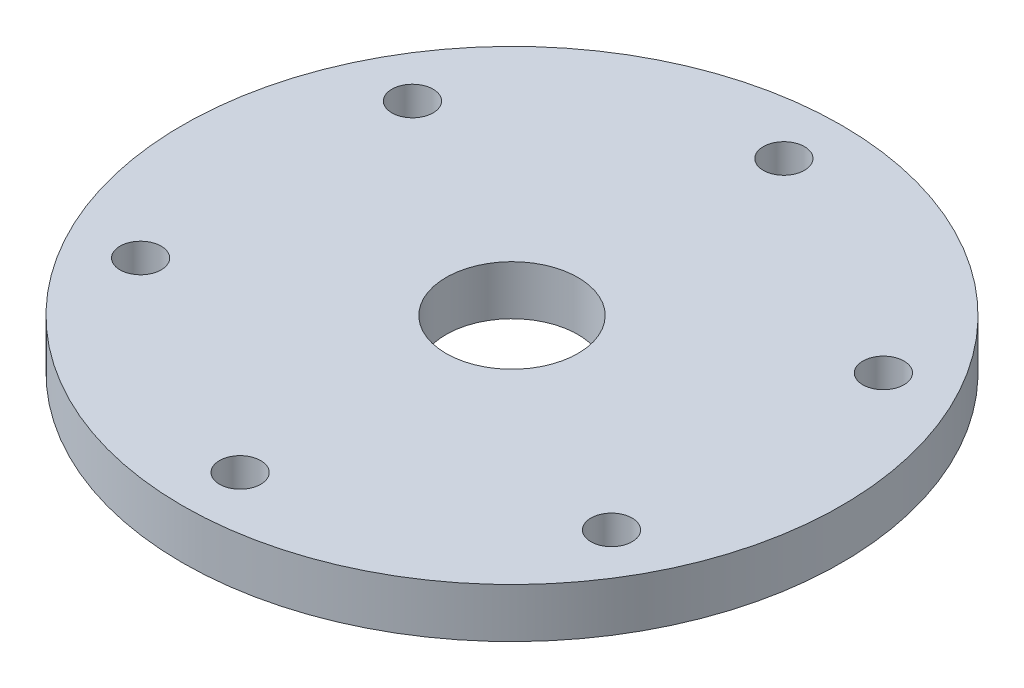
ISO-10303-21;
HEADER;
FILE_DESCRIPTION(('STEP AP214'),'2;1');
FILE_NAME('part.step','',(''),(''),'','','');
FILE_SCHEMA(('AUTOMOTIVE_DESIGN { 1 0 10303 214 1 1 1 1 }'));
ENDSEC;
DATA;
#1=APPLICATION_CONTEXT('core data for automotive mechanical design processes');
#2=APPLICATION_PROTOCOL_DEFINITION('international standard','automotive_design',2000,#1);
#3=PRODUCT_CONTEXT('',#1,'mechanical');
#4=PRODUCT('Part','Part','',(#3));
#5=PRODUCT_RELATED_PRODUCT_CATEGORY('part','',(#4));
#6=PRODUCT_DEFINITION_FORMATION('','',#4);
#7=PRODUCT_DEFINITION_CONTEXT('part definition',#1,'design');
#8=PRODUCT_DEFINITION('design','',#6,#7);
#9=PRODUCT_DEFINITION_SHAPE('','',#8);
#10=(LENGTH_UNIT() NAMED_UNIT(*) SI_UNIT(.MILLI.,.METRE.));
#11=(NAMED_UNIT(*) PLANE_ANGLE_UNIT() SI_UNIT($,.RADIAN.));
#12=(NAMED_UNIT(*) SI_UNIT($,.STERADIAN.) SOLID_ANGLE_UNIT());
#13=UNCERTAINTY_MEASURE_WITH_UNIT(LENGTH_MEASURE(1.E-05),#10,'distance_accuracy_value','');
#14=(GEOMETRIC_REPRESENTATION_CONTEXT(3) GLOBAL_UNCERTAINTY_ASSIGNED_CONTEXT((#13)) GLOBAL_UNIT_ASSIGNED_CONTEXT((#10,
#11,#12)) REPRESENTATION_CONTEXT('',''));
#15=CARTESIAN_POINT('',(0.,0.,0.));
#16=DIRECTION('',(0.,0.,1.));
#17=DIRECTION('',(1.,0.,0.));
#18=AXIS2_PLACEMENT_3D('',#15,#16,#17);
#19=CARTESIAN_POINT('',(0.,-9.525,0.));
#20=DIRECTION('',(0.,1.,0.));
#21=DIRECTION('',(0.,0.,1.));
#22=AXIS2_PLACEMENT_3D('',#19,#20,#21);
#23=CYLINDRICAL_SURFACE('',#22,63.5);
#24=CARTESIAN_POINT('',(0.,-9.525,0.));
#25=DIRECTION('',(0.,1.,0.));
#26=DIRECTION('',(0.,0.,1.));
#27=AXIS2_PLACEMENT_3D('',#24,#25,#26);
#28=CIRCLE('',#27,63.5);
#29=CARTESIAN_POINT('',(0.,-9.525,63.5));
#30=VERTEX_POINT('',#29);
#31=EDGE_CURVE('E10',#30,#30,#28,.T.);
#32=CARTESIAN_POINT('',(0.,0.,0.));
#33=DIRECTION('',(0.,1.,0.));
#34=DIRECTION('',(0.,0.,1.));
#35=AXIS2_PLACEMENT_3D('',#32,#33,#34);
#36=CIRCLE('',#35,63.5);
#37=CARTESIAN_POINT('',(0.,0.,63.5));
#38=VERTEX_POINT('',#37);
#39=EDGE_CURVE('E30',#38,#38,#36,.T.);
#40=CARTESIAN_POINT('',(0.,-9.525,63.5));
#41=CARTESIAN_POINT('',(0.,-9.42578125,63.5));
#42=CARTESIAN_POINT('',(0.,-9.3265625,63.5));
#43=CARTESIAN_POINT('',(0.,-9.128125,63.5));
#44=CARTESIAN_POINT('',(0.,-9.02890625,63.5));
#45=CARTESIAN_POINT('',(0.,-8.83046875,63.5));
#46=CARTESIAN_POINT('',(0.,-8.73125,63.5));
#47=CARTESIAN_POINT('',(0.,-8.5328125,63.5));
#48=CARTESIAN_POINT('',(0.,-8.43359375,63.5));
#49=CARTESIAN_POINT('',(0.,-8.23515625,63.5));
#50=CARTESIAN_POINT('',(0.,-8.1359375,63.5));
#51=CARTESIAN_POINT('',(0.,-7.9375,63.5));
#52=CARTESIAN_POINT('',(0.,-7.83828125,63.5));
#53=CARTESIAN_POINT('',(0.,-7.63984375,63.5));
#54=CARTESIAN_POINT('',(0.,-7.540625,63.5));
#55=CARTESIAN_POINT('',(0.,-7.3421875,63.5));
#56=CARTESIAN_POINT('',(0.,-7.24296875,63.5));
#57=CARTESIAN_POINT('',(0.,-7.04453125,63.5));
#58=CARTESIAN_POINT('',(0.,-6.9453125,63.5));
#59=CARTESIAN_POINT('',(0.,-6.746875,63.5));
#60=CARTESIAN_POINT('',(0.,-6.64765625,63.5));
#61=CARTESIAN_POINT('',(0.,-6.44921875,63.5));
#62=CARTESIAN_POINT('',(0.,-6.35,63.5));
#63=CARTESIAN_POINT('',(0.,-6.1515625,63.5));
#64=CARTESIAN_POINT('',(0.,-6.05234375,63.5));
#65=CARTESIAN_POINT('',(0.,-5.85390625,63.5));
#66=CARTESIAN_POINT('',(0.,-5.7546875,63.5));
#67=CARTESIAN_POINT('',(0.,-5.55625,63.5));
#68=CARTESIAN_POINT('',(0.,-5.45703125,63.5));
#69=CARTESIAN_POINT('',(0.,-5.25859375,63.5));
#70=CARTESIAN_POINT('',(0.,-5.159375,63.5));
#71=CARTESIAN_POINT('',(0.,-4.9609375,63.5));
#72=CARTESIAN_POINT('',(0.,-4.86171875,63.5));
#73=CARTESIAN_POINT('',(0.,-4.66328125,63.5));
#74=CARTESIAN_POINT('',(0.,-4.5640625,63.5));
#75=CARTESIAN_POINT('',(0.,-4.365625,63.5));
#76=CARTESIAN_POINT('',(0.,-4.26640625,63.5));
#77=CARTESIAN_POINT('',(0.,-4.06796875,63.5));
#78=CARTESIAN_POINT('',(0.,-3.96875,63.5));
#79=CARTESIAN_POINT('',(0.,-3.7703125,63.5));
#80=CARTESIAN_POINT('',(0.,-3.67109375,63.5));
#81=CARTESIAN_POINT('',(0.,-3.47265625,63.5));
#82=CARTESIAN_POINT('',(0.,-3.3734375,63.5));
#83=CARTESIAN_POINT('',(0.,-3.175,63.5));
#84=CARTESIAN_POINT('',(0.,-3.07578125,63.5));
#85=CARTESIAN_POINT('',(0.,-2.87734375,63.5));
#86=CARTESIAN_POINT('',(0.,-2.778125,63.5));
#87=CARTESIAN_POINT('',(0.,-2.5796875,63.5));
#88=CARTESIAN_POINT('',(0.,-2.48046875,63.5));
#89=CARTESIAN_POINT('',(0.,-2.28203125,63.5));
#90=CARTESIAN_POINT('',(0.,-2.1828125,63.5));
#91=CARTESIAN_POINT('',(0.,-1.984375,63.5));
#92=CARTESIAN_POINT('',(0.,-1.88515625,63.5));
#93=CARTESIAN_POINT('',(0.,-1.68671875,63.5));
#94=CARTESIAN_POINT('',(0.,-1.5875,63.5));
#95=CARTESIAN_POINT('',(0.,-1.3890625,63.5));
#96=CARTESIAN_POINT('',(0.,-1.28984375,63.5));
#97=CARTESIAN_POINT('',(0.,-1.09140625,63.5));
#98=CARTESIAN_POINT('',(0.,-0.992187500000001,63.5));
#99=CARTESIAN_POINT('',(0.,-0.793750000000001,63.5));
#100=CARTESIAN_POINT('',(0.,-0.69453125,63.5));
#101=CARTESIAN_POINT('',(0.,-0.49609375,63.5));
#102=CARTESIAN_POINT('',(0.,-0.396875,63.5));
#103=CARTESIAN_POINT('',(0.,-0.1984375,63.5));
#104=CARTESIAN_POINT('',(0.,-0.0992187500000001,63.5));
#105=CARTESIAN_POINT('',(0.,0.,63.5));
#106=B_SPLINE_CURVE_WITH_KNOTS('',3,(#40,#41,#42,#43,#44,#45,#46,#47,#48,#49,#50,#51,#52,#53,
#54,#55,#56,#57,#58,#59,#60,#61,#62,#63,#64,#65,#66,#67,#68,#69,#70,#71,#72,#73,#74,#75,#76,#77,
#78,#79,#80,#81,#82,#83,#84,#85,#86,#87,#88,#89,#90,#91,#92,#93,#94,#95,#96,#97,#98,#99,#100,
#101,#102,#103,#104,#105),.UNSPECIFIED.,.F.,.F.,(4,2,2,2,2,2,2,2,2,2,2,2,2,2,2,2,2,2,2,2,2,2,2,
2,2,2,2,2,2,2,2,2,4),(0.,0.29765625,0.5953125,0.892968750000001,1.190625,1.48828125,1.7859375,
2.08359375,2.38125,2.67890625,2.9765625,3.27421875,3.571875,3.86953125,4.1671875,4.46484375,
4.7625,5.06015625,5.3578125,5.65546875,5.953125,6.25078125,6.5484375,6.84609375,7.14375,
7.44140625,7.7390625,8.03671875,8.334375,8.63203125,8.9296875,9.22734375,9.525),.UNSPECIFIED.);
#107=EDGE_CURVE('BSEAM24',#30,#38,#106,.T.);
#108=ORIENTED_EDGE('',*,*,#31,.T.);
#109=ORIENTED_EDGE('',*,*,#39,.F.);
#110=ORIENTED_EDGE('',*,*,#107,.T.);
#111=ORIENTED_EDGE('',*,*,#107,.F.);
#112=EDGE_LOOP('',(#108,#110,#109,#111));
#113=FACE_BOUND('',#112,.T.);
#114=ADVANCED_FACE('F24',(#113),#23,.T.);
#115=CARTESIAN_POINT('',(0.,-9.525,0.));
#116=DIRECTION('',(0.,1.,0.));
#117=DIRECTION('',(0.,0.,1.));
#118=AXIS2_PLACEMENT_3D('',#115,#116,#117);
#119=PLANE('',#118);
#120=CARTESIAN_POINT('',(0.,-9.525,0.));
#121=DIRECTION('',(0.,1.,0.));
#122=DIRECTION('',(0.,0.,1.));
#123=AXIS2_PLACEMENT_3D('',#120,#121,#122);
#124=CIRCLE('',#123,12.699989);
#125=CARTESIAN_POINT('',(0.,-9.525,12.699989));
#126=VERTEX_POINT('',#125);
#127=EDGE_CURVE('E73',#126,#126,#124,.T.);
#128=ORIENTED_EDGE('',*,*,#127,.T.);
#129=EDGE_LOOP('',(#128));
#130=FACE_BOUND('',#129,.T.);
#131=CARTESIAN_POINT('',(-45.368905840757,-9.525,26.1937500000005));
#132=DIRECTION('',(0.,1.,0.));
#133=DIRECTION('',(-0.866025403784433,0.,0.50000000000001));
#134=AXIS2_PLACEMENT_3D('',#131,#132,#133);
#135=CIRCLE('',#134,3.96875);
#136=CARTESIAN_POINT('',(-45.368905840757,-9.525,30.1625000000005));
#137=VERTEX_POINT('',#136);
#138=EDGE_CURVE('E67',#137,#137,#135,.T.);
#139=ORIENTED_EDGE('',*,*,#138,.T.);
#140=EDGE_LOOP('',(#139));
#141=FACE_BOUND('',#140,.T.);
#142=CARTESIAN_POINT('',(-45.3689058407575,-9.525,-26.1937499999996));
#143=DIRECTION('',(0.,1.,0.));
#144=DIRECTION('',(-0.866025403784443,0.,-0.499999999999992));
#145=AXIS2_PLACEMENT_3D('',#142,#143,#144);
#146=CIRCLE('',#145,3.96875);
#147=CARTESIAN_POINT('',(-45.3689058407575,-9.525,-22.2249999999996));
#148=VERTEX_POINT('',#147);
#149=EDGE_CURVE('E61',#148,#148,#146,.T.);
#150=ORIENTED_EDGE('',*,*,#149,.T.);
#151=EDGE_LOOP('',(#150));
#152=FACE_BOUND('',#151,.T.);
#153=CARTESIAN_POINT('',(-3.65820169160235E-13,-9.525,-52.3875));
#154=DIRECTION('',(0.,1.,0.));
#155=DIRECTION('',(0.,0.,-1.));
#156=AXIS2_PLACEMENT_3D('',#153,#154,#155);
#157=CIRCLE('',#156,3.96875);
#158=CARTESIAN_POINT('',(-3.65820169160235E-13,-9.525,-48.41875));
#159=VERTEX_POINT('',#158);
#160=EDGE_CURVE('E55',#159,#159,#157,.T.);
#161=ORIENTED_EDGE('',*,*,#160,.T.);
#162=EDGE_LOOP('',(#161));
#163=FACE_BOUND('',#162,.T.);
#164=CARTESIAN_POINT('',(45.3689058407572,-9.525,-26.1937500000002));
#165=DIRECTION('',(0.,1.,0.));
#166=DIRECTION('',(0.866025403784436,0.,-0.500000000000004));
#167=AXIS2_PLACEMENT_3D('',#164,#165,#166);
#168=CIRCLE('',#167,3.96875);
#169=CARTESIAN_POINT('',(45.3689058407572,-9.525,-22.2250000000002));
#170=VERTEX_POINT('',#169);
#171=EDGE_CURVE('E49',#170,#170,#168,.T.);
#172=ORIENTED_EDGE('',*,*,#171,.T.);
#173=EDGE_LOOP('',(#172));
#174=FACE_BOUND('',#173,.T.);
#175=CARTESIAN_POINT('',(45.3689058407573,-9.525,26.1937499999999));
#176=DIRECTION('',(0.,1.,0.));
#177=DIRECTION('',(0.86602540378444,0.,0.499999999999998));
#178=AXIS2_PLACEMENT_3D('',#175,#176,#177);
#179=CIRCLE('',#178,3.96875);
#180=CARTESIAN_POINT('',(45.3689058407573,-9.525,30.1624999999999));
#181=VERTEX_POINT('',#180);
#182=EDGE_CURVE('E43',#181,#181,#179,.T.);
#183=ORIENTED_EDGE('',*,*,#182,.T.);
#184=EDGE_LOOP('',(#183));
#185=FACE_BOUND('',#184,.T.);
#186=CARTESIAN_POINT('',(0.,-9.525,52.3875));
#187=DIRECTION('',(0.,1.,0.));
#188=DIRECTION('',(0.,0.,1.));
#189=AXIS2_PLACEMENT_3D('',#186,#187,#188);
#190=CIRCLE('',#189,3.96875);
#191=CARTESIAN_POINT('',(0.,-9.525,56.35625));
#192=VERTEX_POINT('',#191);
#193=EDGE_CURVE('E34',#192,#192,#190,.T.);
#194=ORIENTED_EDGE('',*,*,#193,.T.);
#195=EDGE_LOOP('',(#194));
#196=FACE_BOUND('',#195,.T.);
#197=ORIENTED_EDGE('',*,*,#31,.F.);
#198=EDGE_LOOP('',(#197));
#199=FACE_BOUND('',#198,.T.);
#200=ADVANCED_FACE('F87',(#130,#141,#152,#163,#174,#185,#196,#199),#119,.F.);
#201=CARTESIAN_POINT('',(0.,0.,0.));
#202=DIRECTION('',(0.,1.,0.));
#203=DIRECTION('',(0.,0.,1.));
#204=AXIS2_PLACEMENT_3D('',#201,#202,#203);
#205=PLANE('',#204);
#206=CARTESIAN_POINT('',(0.,0.,0.));
#207=DIRECTION('',(0.,1.,0.));
#208=DIRECTION('',(0.,0.,1.));
#209=AXIS2_PLACEMENT_3D('',#206,#207,#208);
#210=CIRCLE('',#209,12.699989);
#211=CARTESIAN_POINT('',(0.,0.,12.699989));
#212=VERTEX_POINT('',#211);
#213=EDGE_CURVE('E76',#212,#212,#210,.T.);
#214=ORIENTED_EDGE('',*,*,#213,.F.);
#215=EDGE_LOOP('',(#214));
#216=FACE_BOUND('',#215,.T.);
#217=CARTESIAN_POINT('',(-45.368905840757,0.,26.1937500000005));
#218=DIRECTION('',(0.,1.,0.));
#219=DIRECTION('',(-0.866025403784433,0.,0.50000000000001));
#220=AXIS2_PLACEMENT_3D('',#217,#218,#219);
#221=CIRCLE('',#220,3.96875);
#222=CARTESIAN_POINT('',(-45.368905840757,0.,30.1625000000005));
#223=VERTEX_POINT('',#222);
#224=EDGE_CURVE('E70',#223,#223,#221,.T.);
#225=ORIENTED_EDGE('',*,*,#224,.F.);
#226=EDGE_LOOP('',(#225));
#227=FACE_BOUND('',#226,.T.);
#228=CARTESIAN_POINT('',(-45.3689058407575,0.,-26.1937499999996));
#229=DIRECTION('',(0.,1.,0.));
#230=DIRECTION('',(-0.866025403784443,0.,-0.499999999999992));
#231=AXIS2_PLACEMENT_3D('',#228,#229,#230);
#232=CIRCLE('',#231,3.96875);
#233=CARTESIAN_POINT('',(-45.3689058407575,0.,-22.2249999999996));
#234=VERTEX_POINT('',#233);
#235=EDGE_CURVE('E64',#234,#234,#232,.T.);
#236=ORIENTED_EDGE('',*,*,#235,.F.);
#237=EDGE_LOOP('',(#236));
#238=FACE_BOUND('',#237,.T.);
#239=CARTESIAN_POINT('',(-3.65820169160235E-13,0.,-52.3875));
#240=DIRECTION('',(0.,1.,0.));
#241=DIRECTION('',(0.,0.,-1.));
#242=AXIS2_PLACEMENT_3D('',#239,#240,#241);
#243=CIRCLE('',#242,3.96875);
#244=CARTESIAN_POINT('',(-3.65820169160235E-13,0.,-48.41875));
#245=VERTEX_POINT('',#244);
#246=EDGE_CURVE('E58',#245,#245,#243,.T.);
#247=ORIENTED_EDGE('',*,*,#246,.F.);
#248=EDGE_LOOP('',(#247));
#249=FACE_BOUND('',#248,.T.);
#250=CARTESIAN_POINT('',(45.3689058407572,0.,-26.1937500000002));
#251=DIRECTION('',(0.,1.,0.));
#252=DIRECTION('',(0.866025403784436,0.,-0.500000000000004));
#253=AXIS2_PLACEMENT_3D('',#250,#251,#252);
#254=CIRCLE('',#253,3.96875);
#255=CARTESIAN_POINT('',(45.3689058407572,0.,-22.2250000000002));
#256=VERTEX_POINT('',#255);
#257=EDGE_CURVE('E52',#256,#256,#254,.T.);
#258=ORIENTED_EDGE('',*,*,#257,.F.);
#259=EDGE_LOOP('',(#258));
#260=FACE_BOUND('',#259,.T.);
#261=CARTESIAN_POINT('',(45.3689058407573,0.,26.1937499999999));
#262=DIRECTION('',(0.,1.,0.));
#263=DIRECTION('',(0.86602540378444,0.,0.499999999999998));
#264=AXIS2_PLACEMENT_3D('',#261,#262,#263);
#265=CIRCLE('',#264,3.96875);
#266=CARTESIAN_POINT('',(45.3689058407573,0.,30.1624999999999));
#267=VERTEX_POINT('',#266);
#268=EDGE_CURVE('E46',#267,#267,#265,.T.);
#269=ORIENTED_EDGE('',*,*,#268,.F.);
#270=EDGE_LOOP('',(#269));
#271=FACE_BOUND('',#270,.T.);
#272=CARTESIAN_POINT('',(0.,0.,52.3875));
#273=DIRECTION('',(0.,1.,0.));
#274=DIRECTION('',(0.,0.,1.));
#275=AXIS2_PLACEMENT_3D('',#272,#273,#274);
#276=CIRCLE('',#275,3.96875);
#277=CARTESIAN_POINT('',(0.,0.,56.35625));
#278=VERTEX_POINT('',#277);
#279=EDGE_CURVE('E38',#278,#278,#276,.T.);
#280=ORIENTED_EDGE('',*,*,#279,.F.);
#281=EDGE_LOOP('',(#280));
#282=FACE_BOUND('',#281,.T.);
#283=ORIENTED_EDGE('',*,*,#39,.T.);
#284=EDGE_LOOP('',(#283));
#285=FACE_BOUND('',#284,.T.);
#286=ADVANCED_FACE('F83',(#216,#227,#238,#249,#260,#271,#282,#285),#205,.T.);
#287=CARTESIAN_POINT('',(0.,-9.525,52.3875));
#288=DIRECTION('',(0.,1.,0.));
#289=DIRECTION('',(0.,0.,1.));
#290=AXIS2_PLACEMENT_3D('',#287,#288,#289);
#291=CYLINDRICAL_SURFACE('',#290,3.96875);
#292=CARTESIAN_POINT('',(0.,-9.525,56.35625));
#293=CARTESIAN_POINT('',(0.,-9.42578125,56.35625));
#294=CARTESIAN_POINT('',(0.,-9.3265625,56.35625));
#295=CARTESIAN_POINT('',(0.,-9.128125,56.35625));
#296=CARTESIAN_POINT('',(0.,-9.02890625,56.35625));
#297=CARTESIAN_POINT('',(0.,-8.83046875,56.35625));
#298=CARTESIAN_POINT('',(0.,-8.73125,56.35625));
#299=CARTESIAN_POINT('',(0.,-8.5328125,56.35625));
#300=CARTESIAN_POINT('',(0.,-8.43359375,56.35625));
#301=CARTESIAN_POINT('',(0.,-8.23515625,56.35625));
#302=CARTESIAN_POINT('',(0.,-8.1359375,56.35625));
#303=CARTESIAN_POINT('',(0.,-7.9375,56.35625));
#304=CARTESIAN_POINT('',(0.,-7.83828125,56.35625));
#305=CARTESIAN_POINT('',(0.,-7.63984375,56.35625));
#306=CARTESIAN_POINT('',(0.,-7.540625,56.35625));
#307=CARTESIAN_POINT('',(0.,-7.3421875,56.35625));
#308=CARTESIAN_POINT('',(0.,-7.24296875,56.35625));
#309=CARTESIAN_POINT('',(0.,-7.04453125,56.35625));
#310=CARTESIAN_POINT('',(0.,-6.9453125,56.35625));
#311=CARTESIAN_POINT('',(0.,-6.746875,56.35625));
#312=CARTESIAN_POINT('',(0.,-6.64765625,56.35625));
#313=CARTESIAN_POINT('',(0.,-6.44921875,56.35625));
#314=CARTESIAN_POINT('',(0.,-6.35,56.35625));
#315=CARTESIAN_POINT('',(0.,-6.1515625,56.35625));
#316=CARTESIAN_POINT('',(0.,-6.05234375,56.35625));
#317=CARTESIAN_POINT('',(0.,-5.85390625,56.35625));
#318=CARTESIAN_POINT('',(0.,-5.7546875,56.35625));
#319=CARTESIAN_POINT('',(0.,-5.55625,56.35625));
#320=CARTESIAN_POINT('',(0.,-5.45703125,56.35625));
#321=CARTESIAN_POINT('',(0.,-5.25859375,56.35625));
#322=CARTESIAN_POINT('',(0.,-5.159375,56.35625));
#323=CARTESIAN_POINT('',(0.,-4.9609375,56.35625));
#324=CARTESIAN_POINT('',(0.,-4.86171875,56.35625));
#325=CARTESIAN_POINT('',(0.,-4.66328125,56.35625));
#326=CARTESIAN_POINT('',(0.,-4.5640625,56.35625));
#327=CARTESIAN_POINT('',(0.,-4.365625,56.35625));
#328=CARTESIAN_POINT('',(0.,-4.26640625,56.35625));
#329=CARTESIAN_POINT('',(0.,-4.06796875,56.35625));
#330=CARTESIAN_POINT('',(0.,-3.96875,56.35625));
#331=CARTESIAN_POINT('',(0.,-3.7703125,56.35625));
#332=CARTESIAN_POINT('',(0.,-3.67109375,56.35625));
#333=CARTESIAN_POINT('',(0.,-3.47265625,56.35625));
#334=CARTESIAN_POINT('',(0.,-3.3734375,56.35625));
#335=CARTESIAN_POINT('',(0.,-3.175,56.35625));
#336=CARTESIAN_POINT('',(0.,-3.07578125,56.35625));
#337=CARTESIAN_POINT('',(0.,-2.87734375,56.35625));
#338=CARTESIAN_POINT('',(0.,-2.778125,56.35625));
#339=CARTESIAN_POINT('',(0.,-2.5796875,56.35625));
#340=CARTESIAN_POINT('',(0.,-2.48046875,56.35625));
#341=CARTESIAN_POINT('',(0.,-2.28203125,56.35625));
#342=CARTESIAN_POINT('',(0.,-2.1828125,56.35625));
#343=CARTESIAN_POINT('',(0.,-1.984375,56.35625));
#344=CARTESIAN_POINT('',(0.,-1.88515625,56.35625));
#345=CARTESIAN_POINT('',(0.,-1.68671875,56.35625));
#346=CARTESIAN_POINT('',(0.,-1.5875,56.35625));
#347=CARTESIAN_POINT('',(0.,-1.3890625,56.35625));
#348=CARTESIAN_POINT('',(0.,-1.28984375,56.35625));
#349=CARTESIAN_POINT('',(0.,-1.09140625,56.35625));
#350=CARTESIAN_POINT('',(0.,-0.992187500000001,56.35625));
#351=CARTESIAN_POINT('',(0.,-0.793750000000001,56.35625));
#352=CARTESIAN_POINT('',(0.,-0.69453125,56.35625));
#353=CARTESIAN_POINT('',(0.,-0.49609375,56.35625));
#354=CARTESIAN_POINT('',(0.,-0.396875,56.35625));
#355=CARTESIAN_POINT('',(0.,-0.1984375,56.35625));
#356=CARTESIAN_POINT('',(0.,-0.0992187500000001,56.35625));
#357=CARTESIAN_POINT('',(0.,0.,56.35625));
#358=B_SPLINE_CURVE_WITH_KNOTS('',3,(#292,#293,#294,#295,#296,#297,#298,#299,#300,#301,#302,
#303,#304,#305,#306,#307,#308,#309,#310,#311,#312,#313,#314,#315,#316,#317,#318,#319,#320,#321,
#322,#323,#324,#325,#326,#327,#328,#329,#330,#331,#332,#333,#334,#335,#336,#337,#338,#339,#340,
#341,#342,#343,#344,#345,#346,#347,#348,#349,#350,#351,#352,#353,#354,#355,#356,#357),
.UNSPECIFIED.,.F.,.F.,(4,2,2,2,2,2,2,2,2,2,2,2,2,2,2,2,2,2,2,2,2,2,2,2,2,2,2,2,2,2,2,2,4),(0.,
0.29765625,0.5953125,0.892968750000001,1.190625,1.48828125,1.7859375,2.08359375,2.38125,
2.67890625,2.9765625,3.27421875,3.571875,3.86953125,4.1671875,4.46484375,4.7625,5.06015625,
5.3578125,5.65546875,5.953125,6.25078125,6.5484375,6.84609375,7.14375,7.44140625,7.7390625,
8.03671875,8.334375,8.63203125,8.9296875,9.22734375,9.525),.UNSPECIFIED.);
#359=EDGE_CURVE('BSEAM86',#192,#278,#358,.T.);
#360=ORIENTED_EDGE('',*,*,#193,.F.);
#361=ORIENTED_EDGE('',*,*,#279,.T.);
#362=ORIENTED_EDGE('',*,*,#359,.T.);
#363=ORIENTED_EDGE('',*,*,#359,.F.);
#364=EDGE_LOOP('',(#360,#362,#361,#363));
#365=FACE_BOUND('',#364,.T.);
#366=ADVANCED_FACE('F86',(#365),#291,.F.);
#367=CARTESIAN_POINT('',(45.3689058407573,-9.525,26.1937499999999));
#368=DIRECTION('',(0.,1.,0.));
#369=DIRECTION('',(0.,0.,1.));
#370=AXIS2_PLACEMENT_3D('',#367,#368,#369);
#371=CYLINDRICAL_SURFACE('',#370,3.96875);
#372=CARTESIAN_POINT('',(45.3689058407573,-9.525,30.1624999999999));
#373=CARTESIAN_POINT('',(45.3689058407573,-9.42578125,30.1624999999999));
#374=CARTESIAN_POINT('',(45.3689058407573,-9.3265625,30.1624999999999));
#375=CARTESIAN_POINT('',(45.3689058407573,-9.128125,30.1624999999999));
#376=CARTESIAN_POINT('',(45.3689058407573,-9.02890625,30.1624999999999));
#377=CARTESIAN_POINT('',(45.3689058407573,-8.83046875,30.1624999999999));
#378=CARTESIAN_POINT('',(45.3689058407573,-8.73125,30.1624999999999));
#379=CARTESIAN_POINT('',(45.3689058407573,-8.5328125,30.1624999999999));
#380=CARTESIAN_POINT('',(45.3689058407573,-8.43359375,30.1624999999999));
#381=CARTESIAN_POINT('',(45.3689058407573,-8.23515625,30.1624999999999));
#382=CARTESIAN_POINT('',(45.3689058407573,-8.1359375,30.1624999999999));
#383=CARTESIAN_POINT('',(45.3689058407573,-7.9375,30.1624999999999));
#384=CARTESIAN_POINT('',(45.3689058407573,-7.83828125,30.1624999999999));
#385=CARTESIAN_POINT('',(45.3689058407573,-7.63984375,30.1624999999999));
#386=CARTESIAN_POINT('',(45.3689058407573,-7.540625,30.1624999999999));
#387=CARTESIAN_POINT('',(45.3689058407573,-7.3421875,30.1624999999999));
#388=CARTESIAN_POINT('',(45.3689058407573,-7.24296875,30.1624999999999));
#389=CARTESIAN_POINT('',(45.3689058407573,-7.04453125,30.1624999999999));
#390=CARTESIAN_POINT('',(45.3689058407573,-6.9453125,30.1624999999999));
#391=CARTESIAN_POINT('',(45.3689058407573,-6.746875,30.1624999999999));
#392=CARTESIAN_POINT('',(45.3689058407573,-6.64765625,30.1624999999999));
#393=CARTESIAN_POINT('',(45.3689058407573,-6.44921875,30.1624999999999));
#394=CARTESIAN_POINT('',(45.3689058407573,-6.35,30.1624999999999));
#395=CARTESIAN_POINT('',(45.3689058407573,-6.1515625,30.1624999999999));
#396=CARTESIAN_POINT('',(45.3689058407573,-6.05234375,30.1624999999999));
#397=CARTESIAN_POINT('',(45.3689058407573,-5.85390625,30.1624999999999));
#398=CARTESIAN_POINT('',(45.3689058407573,-5.7546875,30.1624999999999));
#399=CARTESIAN_POINT('',(45.3689058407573,-5.55625,30.1624999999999));
#400=CARTESIAN_POINT('',(45.3689058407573,-5.45703125,30.1624999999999));
#401=CARTESIAN_POINT('',(45.3689058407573,-5.25859375,30.1624999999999));
#402=CARTESIAN_POINT('',(45.3689058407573,-5.159375,30.1624999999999));
#403=CARTESIAN_POINT('',(45.3689058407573,-4.9609375,30.1624999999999));
#404=CARTESIAN_POINT('',(45.3689058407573,-4.86171875,30.1624999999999));
#405=CARTESIAN_POINT('',(45.3689058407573,-4.66328125,30.1624999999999));
#406=CARTESIAN_POINT('',(45.3689058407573,-4.5640625,30.1624999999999));
#407=CARTESIAN_POINT('',(45.3689058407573,-4.365625,30.1624999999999));
#408=CARTESIAN_POINT('',(45.3689058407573,-4.26640625,30.1624999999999));
#409=CARTESIAN_POINT('',(45.3689058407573,-4.06796875,30.1624999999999));
#410=CARTESIAN_POINT('',(45.3689058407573,-3.96875,30.1624999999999));
#411=CARTESIAN_POINT('',(45.3689058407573,-3.7703125,30.1624999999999));
#412=CARTESIAN_POINT('',(45.3689058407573,-3.67109375,30.1624999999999));
#413=CARTESIAN_POINT('',(45.3689058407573,-3.47265625,30.1624999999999));
#414=CARTESIAN_POINT('',(45.3689058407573,-3.3734375,30.1624999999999));
#415=CARTESIAN_POINT('',(45.3689058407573,-3.175,30.1624999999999));
#416=CARTESIAN_POINT('',(45.3689058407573,-3.07578125,30.1624999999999));
#417=CARTESIAN_POINT('',(45.3689058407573,-2.87734375,30.1624999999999));
#418=CARTESIAN_POINT('',(45.3689058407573,-2.778125,30.1624999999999));
#419=CARTESIAN_POINT('',(45.3689058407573,-2.5796875,30.1624999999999));
#420=CARTESIAN_POINT('',(45.3689058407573,-2.48046875,30.1624999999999));
#421=CARTESIAN_POINT('',(45.3689058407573,-2.28203125,30.1624999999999));
#422=CARTESIAN_POINT('',(45.3689058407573,-2.1828125,30.1624999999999));
#423=CARTESIAN_POINT('',(45.3689058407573,-1.984375,30.1624999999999));
#424=CARTESIAN_POINT('',(45.3689058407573,-1.88515625,30.1624999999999));
#425=CARTESIAN_POINT('',(45.3689058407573,-1.68671875,30.1624999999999));
#426=CARTESIAN_POINT('',(45.3689058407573,-1.5875,30.1624999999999));
#427=CARTESIAN_POINT('',(45.3689058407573,-1.3890625,30.1624999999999));
#428=CARTESIAN_POINT('',(45.3689058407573,-1.28984375,30.1624999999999));
#429=CARTESIAN_POINT('',(45.3689058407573,-1.09140625,30.1624999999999));
#430=CARTESIAN_POINT('',(45.3689058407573,-0.992187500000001,30.1624999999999));
#431=CARTESIAN_POINT('',(45.3689058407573,-0.793750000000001,30.1624999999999));
#432=CARTESIAN_POINT('',(45.3689058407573,-0.69453125,30.1624999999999));
#433=CARTESIAN_POINT('',(45.3689058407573,-0.49609375,30.1624999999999));
#434=CARTESIAN_POINT('',(45.3689058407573,-0.396875,30.1624999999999));
#435=CARTESIAN_POINT('',(45.3689058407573,-0.1984375,30.1624999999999));
#436=CARTESIAN_POINT('',(45.3689058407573,-0.0992187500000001,30.1624999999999));
#437=CARTESIAN_POINT('',(45.3689058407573,0.,30.1624999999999));
#438=B_SPLINE_CURVE_WITH_KNOTS('',3,(#372,#373,#374,#375,#376,#377,#378,#379,#380,#381,#382,
#383,#384,#385,#386,#387,#388,#389,#390,#391,#392,#393,#394,#395,#396,#397,#398,#399,#400,#401,
#402,#403,#404,#405,#406,#407,#408,#409,#410,#411,#412,#413,#414,#415,#416,#417,#418,#419,#420,
#421,#422,#423,#424,#425,#426,#427,#428,#429,#430,#431,#432,#433,#434,#435,#436,#437),
.UNSPECIFIED.,.F.,.F.,(4,2,2,2,2,2,2,2,2,2,2,2,2,2,2,2,2,2,2,2,2,2,2,2,2,2,2,2,2,2,2,2,4),(0.,
0.29765625,0.5953125,0.892968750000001,1.190625,1.48828125,1.7859375,2.08359375,2.38125,
2.67890625,2.9765625,3.27421875,3.571875,3.86953125,4.1671875,4.46484375,4.7625,5.06015625,
5.3578125,5.65546875,5.953125,6.25078125,6.5484375,6.84609375,7.14375,7.44140625,7.7390625,
8.03671875,8.334375,8.63203125,8.9296875,9.22734375,9.525),.UNSPECIFIED.);
#439=EDGE_CURVE('BSEAM102',#181,#267,#438,.T.);
#440=ORIENTED_EDGE('',*,*,#182,.F.);
#441=ORIENTED_EDGE('',*,*,#268,.T.);
#442=ORIENTED_EDGE('',*,*,#439,.T.);
#443=ORIENTED_EDGE('',*,*,#439,.F.);
#444=EDGE_LOOP('',(#440,#442,#441,#443));
#445=FACE_BOUND('',#444,.T.);
#446=ADVANCED_FACE('F102',(#445),#371,.F.);
#447=CARTESIAN_POINT('',(45.3689058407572,-9.525,-26.1937500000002));
#448=DIRECTION('',(0.,1.,0.));
#449=DIRECTION('',(0.,0.,1.));
#450=AXIS2_PLACEMENT_3D('',#447,#448,#449);
#451=CYLINDRICAL_SURFACE('',#450,3.96875);
#452=CARTESIAN_POINT('',(45.3689058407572,-9.525,-22.2250000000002));
#453=CARTESIAN_POINT('',(45.3689058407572,-9.42578125,-22.2250000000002));
#454=CARTESIAN_POINT('',(45.3689058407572,-9.3265625,-22.2250000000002));
#455=CARTESIAN_POINT('',(45.3689058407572,-9.128125,-22.2250000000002));
#456=CARTESIAN_POINT('',(45.3689058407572,-9.02890625,-22.2250000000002));
#457=CARTESIAN_POINT('',(45.3689058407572,-8.83046875,-22.2250000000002));
#458=CARTESIAN_POINT('',(45.3689058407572,-8.73125,-22.2250000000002));
#459=CARTESIAN_POINT('',(45.3689058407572,-8.5328125,-22.2250000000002));
#460=CARTESIAN_POINT('',(45.3689058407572,-8.43359375,-22.2250000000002));
#461=CARTESIAN_POINT('',(45.3689058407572,-8.23515625,-22.2250000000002));
#462=CARTESIAN_POINT('',(45.3689058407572,-8.1359375,-22.2250000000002));
#463=CARTESIAN_POINT('',(45.3689058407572,-7.9375,-22.2250000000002));
#464=CARTESIAN_POINT('',(45.3689058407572,-7.83828125,-22.2250000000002));
#465=CARTESIAN_POINT('',(45.3689058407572,-7.63984375,-22.2250000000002));
#466=CARTESIAN_POINT('',(45.3689058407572,-7.540625,-22.2250000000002));
#467=CARTESIAN_POINT('',(45.3689058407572,-7.3421875,-22.2250000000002));
#468=CARTESIAN_POINT('',(45.3689058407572,-7.24296875,-22.2250000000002));
#469=CARTESIAN_POINT('',(45.3689058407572,-7.04453125,-22.2250000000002));
#470=CARTESIAN_POINT('',(45.3689058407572,-6.9453125,-22.2250000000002));
#471=CARTESIAN_POINT('',(45.3689058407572,-6.746875,-22.2250000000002));
#472=CARTESIAN_POINT('',(45.3689058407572,-6.64765625,-22.2250000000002));
#473=CARTESIAN_POINT('',(45.3689058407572,-6.44921875,-22.2250000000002));
#474=CARTESIAN_POINT('',(45.3689058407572,-6.35,-22.2250000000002));
#475=CARTESIAN_POINT('',(45.3689058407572,-6.1515625,-22.2250000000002));
#476=CARTESIAN_POINT('',(45.3689058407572,-6.05234375,-22.2250000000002));
#477=CARTESIAN_POINT('',(45.3689058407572,-5.85390625,-22.2250000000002));
#478=CARTESIAN_POINT('',(45.3689058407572,-5.7546875,-22.2250000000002));
#479=CARTESIAN_POINT('',(45.3689058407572,-5.55625,-22.2250000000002));
#480=CARTESIAN_POINT('',(45.3689058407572,-5.45703125,-22.2250000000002));
#481=CARTESIAN_POINT('',(45.3689058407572,-5.25859375,-22.2250000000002));
#482=CARTESIAN_POINT('',(45.3689058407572,-5.159375,-22.2250000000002));
#483=CARTESIAN_POINT('',(45.3689058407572,-4.9609375,-22.2250000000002));
#484=CARTESIAN_POINT('',(45.3689058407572,-4.86171875,-22.2250000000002));
#485=CARTESIAN_POINT('',(45.3689058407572,-4.66328125,-22.2250000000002));
#486=CARTESIAN_POINT('',(45.3689058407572,-4.5640625,-22.2250000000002));
#487=CARTESIAN_POINT('',(45.3689058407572,-4.365625,-22.2250000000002));
#488=CARTESIAN_POINT('',(45.3689058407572,-4.26640625,-22.2250000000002));
#489=CARTESIAN_POINT('',(45.3689058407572,-4.06796875,-22.2250000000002));
#490=CARTESIAN_POINT('',(45.3689058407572,-3.96875,-22.2250000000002));
#491=CARTESIAN_POINT('',(45.3689058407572,-3.7703125,-22.2250000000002));
#492=CARTESIAN_POINT('',(45.3689058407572,-3.67109375,-22.2250000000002));
#493=CARTESIAN_POINT('',(45.3689058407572,-3.47265625,-22.2250000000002));
#494=CARTESIAN_POINT('',(45.3689058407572,-3.3734375,-22.2250000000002));
#495=CARTESIAN_POINT('',(45.3689058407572,-3.175,-22.2250000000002));
#496=CARTESIAN_POINT('',(45.3689058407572,-3.07578125,-22.2250000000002));
#497=CARTESIAN_POINT('',(45.3689058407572,-2.87734375,-22.2250000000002));
#498=CARTESIAN_POINT('',(45.3689058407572,-2.778125,-22.2250000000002));
#499=CARTESIAN_POINT('',(45.3689058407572,-2.5796875,-22.2250000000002));
#500=CARTESIAN_POINT('',(45.3689058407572,-2.48046875,-22.2250000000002));
#501=CARTESIAN_POINT('',(45.3689058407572,-2.28203125,-22.2250000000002));
#502=CARTESIAN_POINT('',(45.3689058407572,-2.1828125,-22.2250000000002));
#503=CARTESIAN_POINT('',(45.3689058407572,-1.984375,-22.2250000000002));
#504=CARTESIAN_POINT('',(45.3689058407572,-1.88515625,-22.2250000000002));
#505=CARTESIAN_POINT('',(45.3689058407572,-1.68671875,-22.2250000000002));
#506=CARTESIAN_POINT('',(45.3689058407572,-1.5875,-22.2250000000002));
#507=CARTESIAN_POINT('',(45.3689058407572,-1.3890625,-22.2250000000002));
#508=CARTESIAN_POINT('',(45.3689058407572,-1.28984375,-22.2250000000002));
#509=CARTESIAN_POINT('',(45.3689058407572,-1.09140625,-22.2250000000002));
#510=CARTESIAN_POINT('',(45.3689058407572,-0.992187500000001,-22.2250000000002));
#511=CARTESIAN_POINT('',(45.3689058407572,-0.793750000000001,-22.2250000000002));
#512=CARTESIAN_POINT('',(45.3689058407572,-0.69453125,-22.2250000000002));
#513=CARTESIAN_POINT('',(45.3689058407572,-0.49609375,-22.2250000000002));
#514=CARTESIAN_POINT('',(45.3689058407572,-0.396875,-22.2250000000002));
#515=CARTESIAN_POINT('',(45.3689058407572,-0.1984375,-22.2250000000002));
#516=CARTESIAN_POINT('',(45.3689058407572,-0.0992187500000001,-22.2250000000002));
#517=CARTESIAN_POINT('',(45.3689058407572,0.,-22.2250000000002));
#518=B_SPLINE_CURVE_WITH_KNOTS('',3,(#452,#453,#454,#455,#456,#457,#458,#459,#460,#461,#462,
#463,#464,#465,#466,#467,#468,#469,#470,#471,#472,#473,#474,#475,#476,#477,#478,#479,#480,#481,
#482,#483,#484,#485,#486,#487,#488,#489,#490,#491,#492,#493,#494,#495,#496,#497,#498,#499,#500,
#501,#502,#503,#504,#505,#506,#507,#508,#509,#510,#511,#512,#513,#514,#515,#516,#517),
.UNSPECIFIED.,.F.,.F.,(4,2,2,2,2,2,2,2,2,2,2,2,2,2,2,2,2,2,2,2,2,2,2,2,2,2,2,2,2,2,2,2,4),(0.,
0.29765625,0.5953125,0.892968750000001,1.190625,1.48828125,1.7859375,2.08359375,2.38125,
2.67890625,2.9765625,3.27421875,3.571875,3.86953125,4.1671875,4.46484375,4.7625,5.06015625,
5.3578125,5.65546875,5.953125,6.25078125,6.5484375,6.84609375,7.14375,7.44140625,7.7390625,
8.03671875,8.334375,8.63203125,8.9296875,9.22734375,9.525),.UNSPECIFIED.);
#519=EDGE_CURVE('BSEAM109',#170,#256,#518,.T.);
#520=ORIENTED_EDGE('',*,*,#171,.F.);
#521=ORIENTED_EDGE('',*,*,#257,.T.);
#522=ORIENTED_EDGE('',*,*,#519,.T.);
#523=ORIENTED_EDGE('',*,*,#519,.F.);
#524=EDGE_LOOP('',(#520,#522,#521,#523));
#525=FACE_BOUND('',#524,.T.);
#526=ADVANCED_FACE('F109',(#525),#451,.F.);
#527=CARTESIAN_POINT('',(-3.65820169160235E-13,-9.525,-52.3875));
#528=DIRECTION('',(0.,1.,0.));
#529=DIRECTION('',(0.,0.,1.));
#530=AXIS2_PLACEMENT_3D('',#527,#528,#529);
#531=CYLINDRICAL_SURFACE('',#530,3.96875);
#532=CARTESIAN_POINT('',(-3.65820169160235E-13,-9.525,-48.41875));
#533=CARTESIAN_POINT('',(-3.65820169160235E-13,-9.42578125,-48.41875));
#534=CARTESIAN_POINT('',(-3.65820169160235E-13,-9.3265625,-48.41875));
#535=CARTESIAN_POINT('',(-3.65820169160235E-13,-9.128125,-48.41875));
#536=CARTESIAN_POINT('',(-3.65820169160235E-13,-9.02890625,-48.41875));
#537=CARTESIAN_POINT('',(-3.65820169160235E-13,-8.83046875,-48.41875));
#538=CARTESIAN_POINT('',(-3.65820169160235E-13,-8.73125,-48.41875));
#539=CARTESIAN_POINT('',(-3.65820169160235E-13,-8.5328125,-48.41875));
#540=CARTESIAN_POINT('',(-3.65820169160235E-13,-8.43359375,-48.41875));
#541=CARTESIAN_POINT('',(-3.65820169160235E-13,-8.23515625,-48.41875));
#542=CARTESIAN_POINT('',(-3.65820169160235E-13,-8.1359375,-48.41875));
#543=CARTESIAN_POINT('',(-3.65820169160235E-13,-7.9375,-48.41875));
#544=CARTESIAN_POINT('',(-3.65820169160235E-13,-7.83828125,-48.41875));
#545=CARTESIAN_POINT('',(-3.65820169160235E-13,-7.63984375,-48.41875));
#546=CARTESIAN_POINT('',(-3.65820169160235E-13,-7.540625,-48.41875));
#547=CARTESIAN_POINT('',(-3.65820169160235E-13,-7.3421875,-48.41875));
#548=CARTESIAN_POINT('',(-3.65820169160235E-13,-7.24296875,-48.41875));
#549=CARTESIAN_POINT('',(-3.65820169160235E-13,-7.04453125,-48.41875));
#550=CARTESIAN_POINT('',(-3.65820169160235E-13,-6.9453125,-48.41875));
#551=CARTESIAN_POINT('',(-3.65820169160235E-13,-6.746875,-48.41875));
#552=CARTESIAN_POINT('',(-3.65820169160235E-13,-6.64765625,-48.41875));
#553=CARTESIAN_POINT('',(-3.65820169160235E-13,-6.44921875,-48.41875));
#554=CARTESIAN_POINT('',(-3.65820169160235E-13,-6.35,-48.41875));
#555=CARTESIAN_POINT('',(-3.65820169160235E-13,-6.1515625,-48.41875));
#556=CARTESIAN_POINT('',(-3.65820169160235E-13,-6.05234375,-48.41875));
#557=CARTESIAN_POINT('',(-3.65820169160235E-13,-5.85390625,-48.41875));
#558=CARTESIAN_POINT('',(-3.65820169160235E-13,-5.7546875,-48.41875));
#559=CARTESIAN_POINT('',(-3.65820169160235E-13,-5.55625,-48.41875));
#560=CARTESIAN_POINT('',(-3.65820169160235E-13,-5.45703125,-48.41875));
#561=CARTESIAN_POINT('',(-3.65820169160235E-13,-5.25859375,-48.41875));
#562=CARTESIAN_POINT('',(-3.65820169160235E-13,-5.159375,-48.41875));
#563=CARTESIAN_POINT('',(-3.65820169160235E-13,-4.9609375,-48.41875));
#564=CARTESIAN_POINT('',(-3.65820169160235E-13,-4.86171875,-48.41875));
#565=CARTESIAN_POINT('',(-3.65820169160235E-13,-4.66328125,-48.41875));
#566=CARTESIAN_POINT('',(-3.65820169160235E-13,-4.5640625,-48.41875));
#567=CARTESIAN_POINT('',(-3.65820169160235E-13,-4.365625,-48.41875));
#568=CARTESIAN_POINT('',(-3.65820169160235E-13,-4.26640625,-48.41875));
#569=CARTESIAN_POINT('',(-3.65820169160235E-13,-4.06796875,-48.41875));
#570=CARTESIAN_POINT('',(-3.65820169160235E-13,-3.96875,-48.41875));
#571=CARTESIAN_POINT('',(-3.65820169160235E-13,-3.7703125,-48.41875));
#572=CARTESIAN_POINT('',(-3.65820169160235E-13,-3.67109375,-48.41875));
#573=CARTESIAN_POINT('',(-3.65820169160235E-13,-3.47265625,-48.41875));
#574=CARTESIAN_POINT('',(-3.65820169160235E-13,-3.3734375,-48.41875));
#575=CARTESIAN_POINT('',(-3.65820169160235E-13,-3.175,-48.41875));
#576=CARTESIAN_POINT('',(-3.65820169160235E-13,-3.07578125,-48.41875));
#577=CARTESIAN_POINT('',(-3.65820169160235E-13,-2.87734375,-48.41875));
#578=CARTESIAN_POINT('',(-3.65820169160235E-13,-2.778125,-48.41875));
#579=CARTESIAN_POINT('',(-3.65820169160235E-13,-2.5796875,-48.41875));
#580=CARTESIAN_POINT('',(-3.65820169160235E-13,-2.48046875,-48.41875));
#581=CARTESIAN_POINT('',(-3.65820169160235E-13,-2.28203125,-48.41875));
#582=CARTESIAN_POINT('',(-3.65820169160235E-13,-2.1828125,-48.41875));
#583=CARTESIAN_POINT('',(-3.65820169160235E-13,-1.984375,-48.41875));
#584=CARTESIAN_POINT('',(-3.65820169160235E-13,-1.88515625,-48.41875));
#585=CARTESIAN_POINT('',(-3.65820169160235E-13,-1.68671875,-48.41875));
#586=CARTESIAN_POINT('',(-3.65820169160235E-13,-1.5875,-48.41875));
#587=CARTESIAN_POINT('',(-3.65820169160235E-13,-1.3890625,-48.41875));
#588=CARTESIAN_POINT('',(-3.65820169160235E-13,-1.28984375,-48.41875));
#589=CARTESIAN_POINT('',(-3.65820169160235E-13,-1.09140625,-48.41875));
#590=CARTESIAN_POINT('',(-3.65820169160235E-13,-0.992187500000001,-48.41875));
#591=CARTESIAN_POINT('',(-3.65820169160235E-13,-0.793750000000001,-48.41875));
#592=CARTESIAN_POINT('',(-3.65820169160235E-13,-0.69453125,-48.41875));
#593=CARTESIAN_POINT('',(-3.65820169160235E-13,-0.49609375,-48.41875));
#594=CARTESIAN_POINT('',(-3.65820169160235E-13,-0.396875,-48.41875));
#595=CARTESIAN_POINT('',(-3.65820169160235E-13,-0.1984375,-48.41875));
#596=CARTESIAN_POINT('',(-3.65820169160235E-13,-0.0992187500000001,-48.41875));
#597=CARTESIAN_POINT('',(-3.65820169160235E-13,0.,-48.41875));
#598=B_SPLINE_CURVE_WITH_KNOTS('',3,(#532,#533,#534,#535,#536,#537,#538,#539,#540,#541,#542,
#543,#544,#545,#546,#547,#548,#549,#550,#551,#552,#553,#554,#555,#556,#557,#558,#559,#560,#561,
#562,#563,#564,#565,#566,#567,#568,#569,#570,#571,#572,#573,#574,#575,#576,#577,#578,#579,#580,
#581,#582,#583,#584,#585,#586,#587,#588,#589,#590,#591,#592,#593,#594,#595,#596,#597),
.UNSPECIFIED.,.F.,.F.,(4,2,2,2,2,2,2,2,2,2,2,2,2,2,2,2,2,2,2,2,2,2,2,2,2,2,2,2,2,2,2,2,4),(0.,
0.29765625,0.5953125,0.892968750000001,1.190625,1.48828125,1.7859375,2.08359375,2.38125,
2.67890625,2.9765625,3.27421875,3.571875,3.86953125,4.1671875,4.46484375,4.7625,5.06015625,
5.3578125,5.65546875,5.953125,6.25078125,6.5484375,6.84609375,7.14375,7.44140625,7.7390625,
8.03671875,8.334375,8.63203125,8.9296875,9.22734375,9.525),.UNSPECIFIED.);
#599=EDGE_CURVE('BSEAM138',#159,#245,#598,.T.);
#600=ORIENTED_EDGE('',*,*,#160,.F.);
#601=ORIENTED_EDGE('',*,*,#246,.T.);
#602=ORIENTED_EDGE('',*,*,#599,.T.);
#603=ORIENTED_EDGE('',*,*,#599,.F.);
#604=EDGE_LOOP('',(#600,#602,#601,#603));
#605=FACE_BOUND('',#604,.T.);
#606=ADVANCED_FACE('F138',(#605),#531,.F.);
#607=CARTESIAN_POINT('',(-45.3689058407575,-9.525,-26.1937499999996));
#608=DIRECTION('',(0.,1.,0.));
#609=DIRECTION('',(0.,0.,1.));
#610=AXIS2_PLACEMENT_3D('',#607,#608,#609);
#611=CYLINDRICAL_SURFACE('',#610,3.96875);
#612=CARTESIAN_POINT('',(-45.3689058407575,-9.525,-22.2249999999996));
#613=CARTESIAN_POINT('',(-45.3689058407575,-9.42578125,-22.2249999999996));
#614=CARTESIAN_POINT('',(-45.3689058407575,-9.3265625,-22.2249999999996));
#615=CARTESIAN_POINT('',(-45.3689058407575,-9.128125,-22.2249999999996));
#616=CARTESIAN_POINT('',(-45.3689058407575,-9.02890625,-22.2249999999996));
#617=CARTESIAN_POINT('',(-45.3689058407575,-8.83046875,-22.2249999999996));
#618=CARTESIAN_POINT('',(-45.3689058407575,-8.73125,-22.2249999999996));
#619=CARTESIAN_POINT('',(-45.3689058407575,-8.5328125,-22.2249999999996));
#620=CARTESIAN_POINT('',(-45.3689058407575,-8.43359375,-22.2249999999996));
#621=CARTESIAN_POINT('',(-45.3689058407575,-8.23515625,-22.2249999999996));
#622=CARTESIAN_POINT('',(-45.3689058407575,-8.1359375,-22.2249999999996));
#623=CARTESIAN_POINT('',(-45.3689058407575,-7.9375,-22.2249999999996));
#624=CARTESIAN_POINT('',(-45.3689058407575,-7.83828125,-22.2249999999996));
#625=CARTESIAN_POINT('',(-45.3689058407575,-7.63984375,-22.2249999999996));
#626=CARTESIAN_POINT('',(-45.3689058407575,-7.540625,-22.2249999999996));
#627=CARTESIAN_POINT('',(-45.3689058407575,-7.3421875,-22.2249999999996));
#628=CARTESIAN_POINT('',(-45.3689058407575,-7.24296875,-22.2249999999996));
#629=CARTESIAN_POINT('',(-45.3689058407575,-7.04453125,-22.2249999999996));
#630=CARTESIAN_POINT('',(-45.3689058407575,-6.9453125,-22.2249999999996));
#631=CARTESIAN_POINT('',(-45.3689058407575,-6.746875,-22.2249999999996));
#632=CARTESIAN_POINT('',(-45.3689058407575,-6.64765625,-22.2249999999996));
#633=CARTESIAN_POINT('',(-45.3689058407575,-6.44921875,-22.2249999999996));
#634=CARTESIAN_POINT('',(-45.3689058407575,-6.35,-22.2249999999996));
#635=CARTESIAN_POINT('',(-45.3689058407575,-6.1515625,-22.2249999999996));
#636=CARTESIAN_POINT('',(-45.3689058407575,-6.05234375,-22.2249999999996));
#637=CARTESIAN_POINT('',(-45.3689058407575,-5.85390625,-22.2249999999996));
#638=CARTESIAN_POINT('',(-45.3689058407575,-5.7546875,-22.2249999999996));
#639=CARTESIAN_POINT('',(-45.3689058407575,-5.55625,-22.2249999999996));
#640=CARTESIAN_POINT('',(-45.3689058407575,-5.45703125,-22.2249999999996));
#641=CARTESIAN_POINT('',(-45.3689058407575,-5.25859375,-22.2249999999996));
#642=CARTESIAN_POINT('',(-45.3689058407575,-5.159375,-22.2249999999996));
#643=CARTESIAN_POINT('',(-45.3689058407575,-4.9609375,-22.2249999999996));
#644=CARTESIAN_POINT('',(-45.3689058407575,-4.86171875,-22.2249999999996));
#645=CARTESIAN_POINT('',(-45.3689058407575,-4.66328125,-22.2249999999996));
#646=CARTESIAN_POINT('',(-45.3689058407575,-4.5640625,-22.2249999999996));
#647=CARTESIAN_POINT('',(-45.3689058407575,-4.365625,-22.2249999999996));
#648=CARTESIAN_POINT('',(-45.3689058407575,-4.26640625,-22.2249999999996));
#649=CARTESIAN_POINT('',(-45.3689058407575,-4.06796875,-22.2249999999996));
#650=CARTESIAN_POINT('',(-45.3689058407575,-3.96875,-22.2249999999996));
#651=CARTESIAN_POINT('',(-45.3689058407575,-3.7703125,-22.2249999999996));
#652=CARTESIAN_POINT('',(-45.3689058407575,-3.67109375,-22.2249999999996));
#653=CARTESIAN_POINT('',(-45.3689058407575,-3.47265625,-22.2249999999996));
#654=CARTESIAN_POINT('',(-45.3689058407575,-3.3734375,-22.2249999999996));
#655=CARTESIAN_POINT('',(-45.3689058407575,-3.175,-22.2249999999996));
#656=CARTESIAN_POINT('',(-45.3689058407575,-3.07578125,-22.2249999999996));
#657=CARTESIAN_POINT('',(-45.3689058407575,-2.87734375,-22.2249999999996));
#658=CARTESIAN_POINT('',(-45.3689058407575,-2.778125,-22.2249999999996));
#659=CARTESIAN_POINT('',(-45.3689058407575,-2.5796875,-22.2249999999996));
#660=CARTESIAN_POINT('',(-45.3689058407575,-2.48046875,-22.2249999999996));
#661=CARTESIAN_POINT('',(-45.3689058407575,-2.28203125,-22.2249999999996));
#662=CARTESIAN_POINT('',(-45.3689058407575,-2.1828125,-22.2249999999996));
#663=CARTESIAN_POINT('',(-45.3689058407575,-1.984375,-22.2249999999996));
#664=CARTESIAN_POINT('',(-45.3689058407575,-1.88515625,-22.2249999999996));
#665=CARTESIAN_POINT('',(-45.3689058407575,-1.68671875,-22.2249999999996));
#666=CARTESIAN_POINT('',(-45.3689058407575,-1.5875,-22.2249999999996));
#667=CARTESIAN_POINT('',(-45.3689058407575,-1.3890625,-22.2249999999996));
#668=CARTESIAN_POINT('',(-45.3689058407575,-1.28984375,-22.2249999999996));
#669=CARTESIAN_POINT('',(-45.3689058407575,-1.09140625,-22.2249999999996));
#670=CARTESIAN_POINT('',(-45.3689058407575,-0.992187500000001,-22.2249999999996));
#671=CARTESIAN_POINT('',(-45.3689058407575,-0.793750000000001,-22.2249999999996));
#672=CARTESIAN_POINT('',(-45.3689058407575,-0.69453125,-22.2249999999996));
#673=CARTESIAN_POINT('',(-45.3689058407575,-0.49609375,-22.2249999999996));
#674=CARTESIAN_POINT('',(-45.3689058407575,-0.396875,-22.2249999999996));
#675=CARTESIAN_POINT('',(-45.3689058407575,-0.1984375,-22.2249999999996));
#676=CARTESIAN_POINT('',(-45.3689058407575,-0.0992187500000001,-22.2249999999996));
#677=CARTESIAN_POINT('',(-45.3689058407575,0.,-22.2249999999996));
#678=B_SPLINE_CURVE_WITH_KNOTS('',3,(#612,#613,#614,#615,#616,#617,#618,#619,#620,#621,#622,
#623,#624,#625,#626,#627,#628,#629,#630,#631,#632,#633,#634,#635,#636,#637,#638,#639,#640,#641,
#642,#643,#644,#645,#646,#647,#648,#649,#650,#651,#652,#653,#654,#655,#656,#657,#658,#659,#660,
#661,#662,#663,#664,#665,#666,#667,#668,#669,#670,#671,#672,#673,#674,#675,#676,#677),
.UNSPECIFIED.,.F.,.F.,(4,2,2,2,2,2,2,2,2,2,2,2,2,2,2,2,2,2,2,2,2,2,2,2,2,2,2,2,2,2,2,2,4),(0.,
0.29765625,0.5953125,0.892968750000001,1.190625,1.48828125,1.7859375,2.08359375,2.38125,
2.67890625,2.9765625,3.27421875,3.571875,3.86953125,4.1671875,4.46484375,4.7625,5.06015625,
5.3578125,5.65546875,5.953125,6.25078125,6.5484375,6.84609375,7.14375,7.44140625,7.7390625,
8.03671875,8.334375,8.63203125,8.9296875,9.22734375,9.525),.UNSPECIFIED.);
#679=EDGE_CURVE('BSEAM143',#148,#234,#678,.T.);
#680=ORIENTED_EDGE('',*,*,#149,.F.);
#681=ORIENTED_EDGE('',*,*,#235,.T.);
#682=ORIENTED_EDGE('',*,*,#679,.T.);
#683=ORIENTED_EDGE('',*,*,#679,.F.);
#684=EDGE_LOOP('',(#680,#682,#681,#683));
#685=FACE_BOUND('',#684,.T.);
#686=ADVANCED_FACE('F143',(#685),#611,.F.);
#687=CARTESIAN_POINT('',(-45.368905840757,-9.525,26.1937500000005));
#688=DIRECTION('',(0.,1.,0.));
#689=DIRECTION('',(0.,0.,1.));
#690=AXIS2_PLACEMENT_3D('',#687,#688,#689);
#691=CYLINDRICAL_SURFACE('',#690,3.96875);
#692=CARTESIAN_POINT('',(-45.368905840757,-9.525,30.1625000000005));
#693=CARTESIAN_POINT('',(-45.368905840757,-9.42578125,30.1625000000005));
#694=CARTESIAN_POINT('',(-45.368905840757,-9.3265625,30.1625000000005));
#695=CARTESIAN_POINT('',(-45.368905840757,-9.128125,30.1625000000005));
#696=CARTESIAN_POINT('',(-45.368905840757,-9.02890625,30.1625000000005));
#697=CARTESIAN_POINT('',(-45.368905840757,-8.83046875,30.1625000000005));
#698=CARTESIAN_POINT('',(-45.368905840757,-8.73125,30.1625000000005));
#699=CARTESIAN_POINT('',(-45.368905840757,-8.5328125,30.1625000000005));
#700=CARTESIAN_POINT('',(-45.368905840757,-8.43359375,30.1625000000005));
#701=CARTESIAN_POINT('',(-45.368905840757,-8.23515625,30.1625000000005));
#702=CARTESIAN_POINT('',(-45.368905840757,-8.1359375,30.1625000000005));
#703=CARTESIAN_POINT('',(-45.368905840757,-7.9375,30.1625000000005));
#704=CARTESIAN_POINT('',(-45.368905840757,-7.83828125,30.1625000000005));
#705=CARTESIAN_POINT('',(-45.368905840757,-7.63984375,30.1625000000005));
#706=CARTESIAN_POINT('',(-45.368905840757,-7.540625,30.1625000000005));
#707=CARTESIAN_POINT('',(-45.368905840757,-7.3421875,30.1625000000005));
#708=CARTESIAN_POINT('',(-45.368905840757,-7.24296875,30.1625000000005));
#709=CARTESIAN_POINT('',(-45.368905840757,-7.04453125,30.1625000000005));
#710=CARTESIAN_POINT('',(-45.368905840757,-6.9453125,30.1625000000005));
#711=CARTESIAN_POINT('',(-45.368905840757,-6.746875,30.1625000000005));
#712=CARTESIAN_POINT('',(-45.368905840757,-6.64765625,30.1625000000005));
#713=CARTESIAN_POINT('',(-45.368905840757,-6.44921875,30.1625000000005));
#714=CARTESIAN_POINT('',(-45.368905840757,-6.35,30.1625000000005));
#715=CARTESIAN_POINT('',(-45.368905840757,-6.1515625,30.1625000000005));
#716=CARTESIAN_POINT('',(-45.368905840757,-6.05234375,30.1625000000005));
#717=CARTESIAN_POINT('',(-45.368905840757,-5.85390625,30.1625000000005));
#718=CARTESIAN_POINT('',(-45.368905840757,-5.7546875,30.1625000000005));
#719=CARTESIAN_POINT('',(-45.368905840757,-5.55625,30.1625000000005));
#720=CARTESIAN_POINT('',(-45.368905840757,-5.45703125,30.1625000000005));
#721=CARTESIAN_POINT('',(-45.368905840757,-5.25859375,30.1625000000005));
#722=CARTESIAN_POINT('',(-45.368905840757,-5.159375,30.1625000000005));
#723=CARTESIAN_POINT('',(-45.368905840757,-4.9609375,30.1625000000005));
#724=CARTESIAN_POINT('',(-45.368905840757,-4.86171875,30.1625000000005));
#725=CARTESIAN_POINT('',(-45.368905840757,-4.66328125,30.1625000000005));
#726=CARTESIAN_POINT('',(-45.368905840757,-4.5640625,30.1625000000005));
#727=CARTESIAN_POINT('',(-45.368905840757,-4.365625,30.1625000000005));
#728=CARTESIAN_POINT('',(-45.368905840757,-4.26640625,30.1625000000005));
#729=CARTESIAN_POINT('',(-45.368905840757,-4.06796875,30.1625000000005));
#730=CARTESIAN_POINT('',(-45.368905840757,-3.96875,30.1625000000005));
#731=CARTESIAN_POINT('',(-45.368905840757,-3.7703125,30.1625000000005));
#732=CARTESIAN_POINT('',(-45.368905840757,-3.67109375,30.1625000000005));
#733=CARTESIAN_POINT('',(-45.368905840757,-3.47265625,30.1625000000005));
#734=CARTESIAN_POINT('',(-45.368905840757,-3.3734375,30.1625000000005));
#735=CARTESIAN_POINT('',(-45.368905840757,-3.175,30.1625000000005));
#736=CARTESIAN_POINT('',(-45.368905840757,-3.07578125,30.1625000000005));
#737=CARTESIAN_POINT('',(-45.368905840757,-2.87734375,30.1625000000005));
#738=CARTESIAN_POINT('',(-45.368905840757,-2.778125,30.1625000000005));
#739=CARTESIAN_POINT('',(-45.368905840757,-2.5796875,30.1625000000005));
#740=CARTESIAN_POINT('',(-45.368905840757,-2.48046875,30.1625000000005));
#741=CARTESIAN_POINT('',(-45.368905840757,-2.28203125,30.1625000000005));
#742=CARTESIAN_POINT('',(-45.368905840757,-2.1828125,30.1625000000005));
#743=CARTESIAN_POINT('',(-45.368905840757,-1.984375,30.1625000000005));
#744=CARTESIAN_POINT('',(-45.368905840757,-1.88515625,30.1625000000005));
#745=CARTESIAN_POINT('',(-45.368905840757,-1.68671875,30.1625000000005));
#746=CARTESIAN_POINT('',(-45.368905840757,-1.5875,30.1625000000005));
#747=CARTESIAN_POINT('',(-45.368905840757,-1.3890625,30.1625000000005));
#748=CARTESIAN_POINT('',(-45.368905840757,-1.28984375,30.1625000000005));
#749=CARTESIAN_POINT('',(-45.368905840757,-1.09140625,30.1625000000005));
#750=CARTESIAN_POINT('',(-45.368905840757,-0.992187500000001,30.1625000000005));
#751=CARTESIAN_POINT('',(-45.368905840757,-0.793750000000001,30.1625000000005));
#752=CARTESIAN_POINT('',(-45.368905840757,-0.69453125,30.1625000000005));
#753=CARTESIAN_POINT('',(-45.368905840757,-0.49609375,30.1625000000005));
#754=CARTESIAN_POINT('',(-45.368905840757,-0.396875,30.1625000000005));
#755=CARTESIAN_POINT('',(-45.368905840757,-0.1984375,30.1625000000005));
#756=CARTESIAN_POINT('',(-45.368905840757,-0.0992187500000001,30.1625000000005));
#757=CARTESIAN_POINT('',(-45.368905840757,0.,30.1625000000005));
#758=B_SPLINE_CURVE_WITH_KNOTS('',3,(#692,#693,#694,#695,#696,#697,#698,#699,#700,#701,#702,
#703,#704,#705,#706,#707,#708,#709,#710,#711,#712,#713,#714,#715,#716,#717,#718,#719,#720,#721,
#722,#723,#724,#725,#726,#727,#728,#729,#730,#731,#732,#733,#734,#735,#736,#737,#738,#739,#740,
#741,#742,#743,#744,#745,#746,#747,#748,#749,#750,#751,#752,#753,#754,#755,#756,#757),
.UNSPECIFIED.,.F.,.F.,(4,2,2,2,2,2,2,2,2,2,2,2,2,2,2,2,2,2,2,2,2,2,2,2,2,2,2,2,2,2,2,2,4),(0.,
0.29765625,0.5953125,0.892968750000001,1.190625,1.48828125,1.7859375,2.08359375,2.38125,
2.67890625,2.9765625,3.27421875,3.571875,3.86953125,4.1671875,4.46484375,4.7625,5.06015625,
5.3578125,5.65546875,5.953125,6.25078125,6.5484375,6.84609375,7.14375,7.44140625,7.7390625,
8.03671875,8.334375,8.63203125,8.9296875,9.22734375,9.525),.UNSPECIFIED.);
#759=EDGE_CURVE('BSEAM149',#137,#223,#758,.T.);
#760=ORIENTED_EDGE('',*,*,#138,.F.);
#761=ORIENTED_EDGE('',*,*,#224,.T.);
#762=ORIENTED_EDGE('',*,*,#759,.T.);
#763=ORIENTED_EDGE('',*,*,#759,.F.);
#764=EDGE_LOOP('',(#760,#762,#761,#763));
#765=FACE_BOUND('',#764,.T.);
#766=ADVANCED_FACE('F149',(#765),#691,.F.);
#767=CARTESIAN_POINT('',(0.,0.,0.));
#768=DIRECTION('',(0.,1.,0.));
#769=DIRECTION('',(0.,0.,1.));
#770=AXIS2_PLACEMENT_3D('',#767,#768,#769);
#771=CYLINDRICAL_SURFACE('',#770,12.699989);
#772=ORIENTED_EDGE('',*,*,#213,.T.);
#773=EDGE_LOOP('',(#772));
#774=FACE_BOUND('',#773,.T.);
#775=ORIENTED_EDGE('',*,*,#127,.F.);
#776=EDGE_LOOP('',(#775));
#777=FACE_BOUND('',#776,.T.);
#778=ADVANCED_FACE('F80',(#774,#777),#771,.F.);
#779=CLOSED_SHELL('',(#114,#200,#286,#366,#446,#526,#606,#686,#766,#778));
#780=MANIFOLD_SOLID_BREP('B2',#779);
#781=ADVANCED_BREP_SHAPE_REPRESENTATION('',(#18,#780),#14);
#782=SHAPE_DEFINITION_REPRESENTATION(#9,#781);
ENDSEC;
END-ISO-10303-21;
